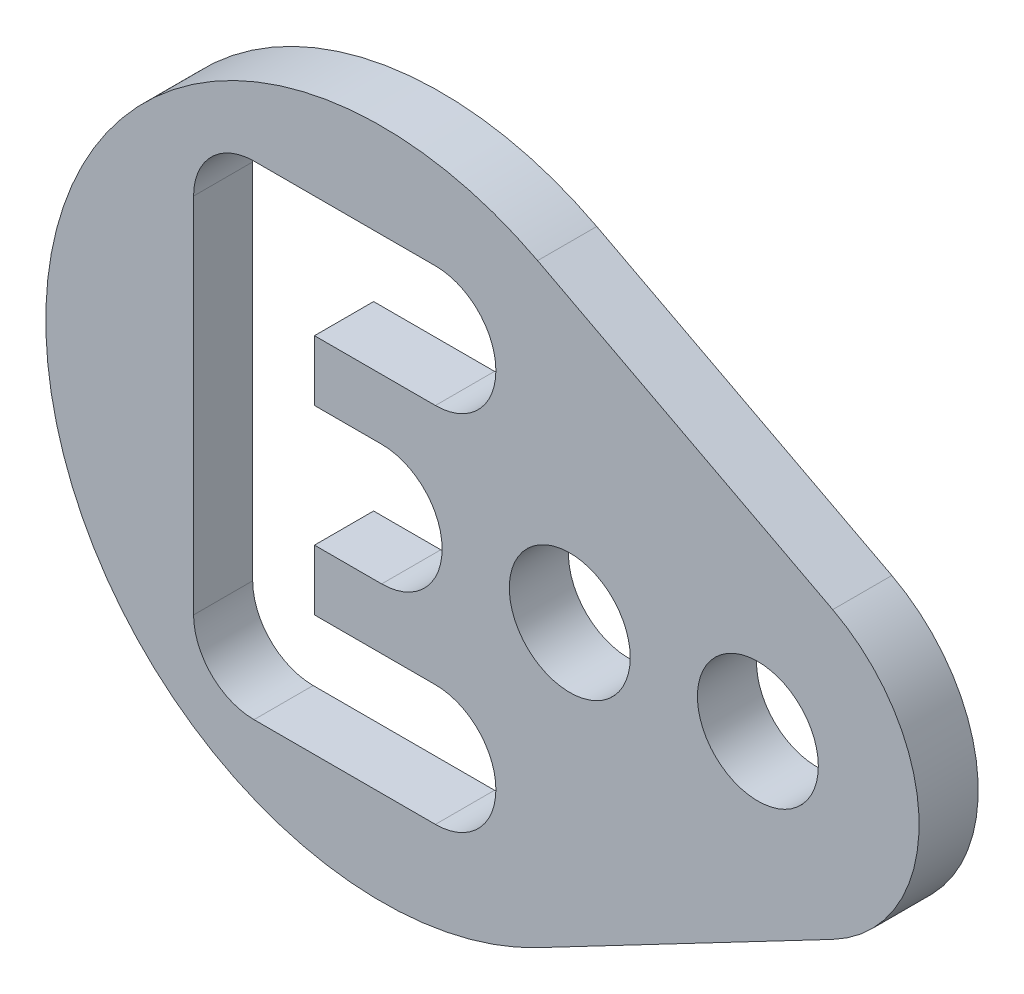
from build123d import *

# Parameters (mm, degrees)
CROQUIS1_R              = 2.25
SALIENTE_EXTRUIR1_DEPTH = 2.2


with BuildPart() as part:
    # Croquis1 → Saliente-Extruir1 (new body)
    with BuildSketch(Plane.XY):
        with BuildLine():
            Line((12.803571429, -2.071068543), (23.785714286, 3.6858871))
            ThreePointArc((23.785714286, 3.6858871), (27, 9), (23.785714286, 14.3141129))
            Line((23.785714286, 14.3141129), (12.803571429, 20.071068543))
            ThreePointArc((12.803571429, 20.071068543), (-5.5, 9), (12.803571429, -2.071068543))
        make_face()
        with Locations((14, 9)):
            Circle(CROQUIS1_R, mode=Mode.SUBTRACT)
        with Locations((21, 9)):
            Circle(CROQUIS1_R, mode=Mode.SUBTRACT)
        with BuildLine():
            Line((9, 13.5), (4.5, 13.5))
            Line((4.5, 13.5), (4.5, 11.25))
            Line((4.5, 11.25), (7, 11.25))
            ThreePointArc((7, 11.25), (9.25, 9), (7, 6.75))
            Line((7, 6.75), (4.5, 6.75))
            Line((4.5, 6.75), (4.5, 4.5))
            Line((4.5, 4.5), (9, 4.5))
            ThreePointArc((9, 4.5), (11.25, 2.25), (9, 0))
            Line((9, 0), (2.25, 0))
            ThreePointArc((2.25, 0), (0.659009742, 0.659009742), (0, 2.25))
            Line((0, 2.25), (0, 15.75))
            ThreePointArc((0, 15.75), (0.659009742, 17.340990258), (2.25, 18))
            Line((2.25, 18), (9, 18))
            ThreePointArc((9, 18), (11.25, 15.75), (9, 13.5))
        make_face(mode=Mode.SUBTRACT)
    extrude(amount=SALIENTE_EXTRUIR1_DEPTH)


solid = part.part
